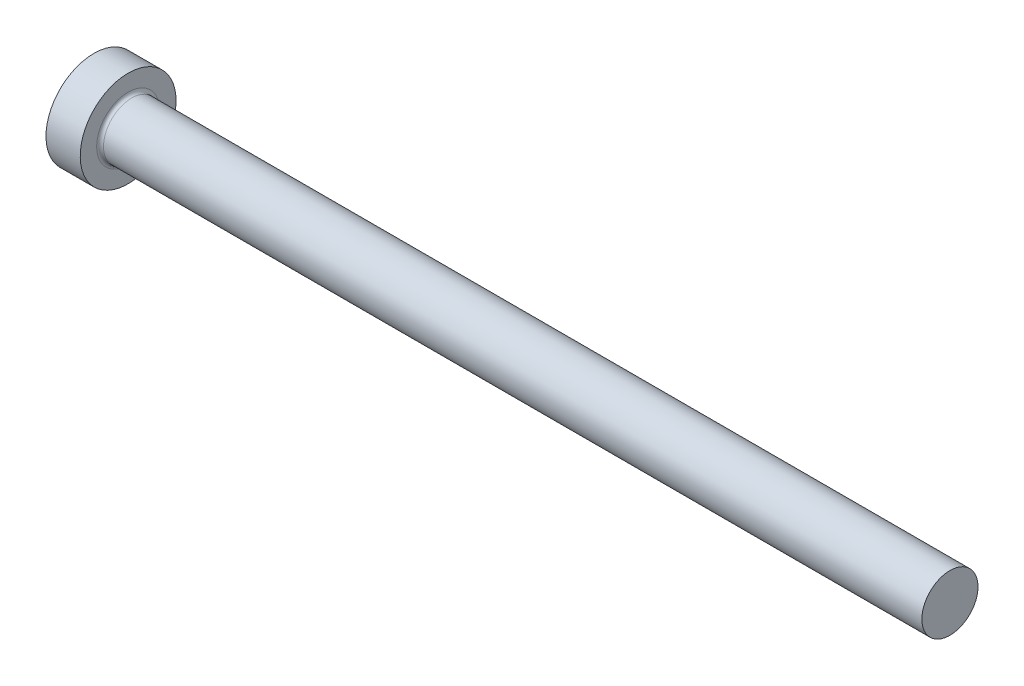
ISO-10303-21;
HEADER;
FILE_DESCRIPTION(('STEP AP214'),'2;1');
FILE_NAME('part.step','',(''),(''),'','','');
FILE_SCHEMA(('AUTOMOTIVE_DESIGN { 1 0 10303 214 1 1 1 1 }'));
ENDSEC;
DATA;
#1=APPLICATION_CONTEXT('core data for automotive mechanical design processes');
#2=APPLICATION_PROTOCOL_DEFINITION('international standard','automotive_design',2000,#1);
#3=PRODUCT_CONTEXT('',#1,'mechanical');
#4=PRODUCT('Part','Part','',(#3));
#5=PRODUCT_RELATED_PRODUCT_CATEGORY('part','',(#4));
#6=PRODUCT_DEFINITION_FORMATION('','',#4);
#7=PRODUCT_DEFINITION_CONTEXT('part definition',#1,'design');
#8=PRODUCT_DEFINITION('design','',#6,#7);
#9=PRODUCT_DEFINITION_SHAPE('','',#8);
#10=(LENGTH_UNIT() NAMED_UNIT(*) SI_UNIT(.MILLI.,.METRE.));
#11=(NAMED_UNIT(*) PLANE_ANGLE_UNIT() SI_UNIT($,.RADIAN.));
#12=(NAMED_UNIT(*) SI_UNIT($,.STERADIAN.) SOLID_ANGLE_UNIT());
#13=UNCERTAINTY_MEASURE_WITH_UNIT(LENGTH_MEASURE(1.E-05),#10,'distance_accuracy_value','');
#14=(GEOMETRIC_REPRESENTATION_CONTEXT(3) GLOBAL_UNCERTAINTY_ASSIGNED_CONTEXT((#13)) GLOBAL_UNIT_ASSIGNED_CONTEXT((#10,
#11,#12)) REPRESENTATION_CONTEXT('',''));
#15=CARTESIAN_POINT('',(0.,0.,0.));
#16=DIRECTION('',(0.,0.,1.));
#17=DIRECTION('',(1.,0.,0.));
#18=AXIS2_PLACEMENT_3D('',#15,#16,#17);
#19=CARTESIAN_POINT('',(0.,0.,0.));
#20=DIRECTION('',(-1.,0.,0.));
#21=DIRECTION('',(0.,-1.,0.));
#22=AXIS2_PLACEMENT_3D('',#19,#20,#21);
#23=PLANE('',#22);
#24=CARTESIAN_POINT('',(0.,0.,0.));
#25=DIRECTION('',(1.,0.,0.));
#26=DIRECTION('',(0.,1.,0.));
#27=AXIS2_PLACEMENT_3D('',#24,#25,#26);
#28=CIRCLE('',#27,7.);
#29=CARTESIAN_POINT('',(0.,7.,0.));
#30=VERTEX_POINT('',#29);
#31=EDGE_CURVE('E25',#30,#30,#28,.T.);
#32=ORIENTED_EDGE('',*,*,#31,.F.);
#33=EDGE_LOOP('',(#32));
#34=FACE_BOUND('',#33,.T.);
#35=ADVANCED_FACE('F14',(#34),#23,.T.);
#36=CARTESIAN_POINT('',(125.,0.,0.));
#37=DIRECTION('',(1.,0.,0.));
#38=DIRECTION('',(0.,1.,0.));
#39=AXIS2_PLACEMENT_3D('',#36,#37,#38);
#40=CYLINDRICAL_SURFACE('',#39,7.);
#41=ORIENTED_EDGE('',*,*,#31,.T.);
#42=EDGE_LOOP('',(#41));
#43=FACE_BOUND('',#42,.T.);
#44=CARTESIAN_POINT('',(5.,0.,0.));
#45=DIRECTION('',(1.,0.,0.));
#46=DIRECTION('',(0.,1.,0.));
#47=AXIS2_PLACEMENT_3D('',#44,#45,#46);
#48=CIRCLE('',#47,7.);
#49=CARTESIAN_POINT('',(5.,7.,0.));
#50=VERTEX_POINT('',#49);
#51=EDGE_CURVE('E29',#50,#50,#48,.T.);
#52=ORIENTED_EDGE('',*,*,#51,.F.);
#53=EDGE_LOOP('',(#52));
#54=FACE_BOUND('',#53,.T.);
#55=ADVANCED_FACE('F51',(#43,#54),#40,.T.);
#56=CARTESIAN_POINT('',(5.,7.,0.));
#57=DIRECTION('',(1.,0.,0.));
#58=DIRECTION('',(0.,1.,0.));
#59=AXIS2_PLACEMENT_3D('',#56,#57,#58);
#60=PLANE('',#59);
#61=CARTESIAN_POINT('',(5.,0.,0.));
#62=DIRECTION('',(1.,0.,0.));
#63=DIRECTION('',(0.,1.,0.));
#64=AXIS2_PLACEMENT_3D('',#61,#62,#63);
#65=CIRCLE('',#64,4.6);
#66=CARTESIAN_POINT('',(5.,4.6,0.));
#67=VERTEX_POINT('',#66);
#68=EDGE_CURVE('E9',#67,#67,#65,.F.);
#69=ORIENTED_EDGE('',*,*,#68,.T.);
#70=EDGE_LOOP('',(#69));
#71=FACE_BOUND('',#70,.T.);
#72=ORIENTED_EDGE('',*,*,#51,.T.);
#73=EDGE_LOOP('',(#72));
#74=FACE_BOUND('',#73,.T.);
#75=ADVANCED_FACE('F42',(#71,#74),#60,.T.);
#76=CARTESIAN_POINT('',(125.,0.,0.));
#77=DIRECTION('',(1.,0.,0.));
#78=DIRECTION('',(0.,1.,0.));
#79=AXIS2_PLACEMENT_3D('',#76,#77,#78);
#80=CYLINDRICAL_SURFACE('',#79,4.1);
#81=CARTESIAN_POINT('',(5.5,0.,0.));
#82=DIRECTION('',(1.,0.,0.));
#83=DIRECTION('',(0.,1.,0.));
#84=AXIS2_PLACEMENT_3D('',#81,#82,#83);
#85=CIRCLE('',#84,4.1);
#86=CARTESIAN_POINT('',(5.5,4.1,0.));
#87=VERTEX_POINT('',#86);
#88=EDGE_CURVE('E21',#87,#87,#85,.T.);
#89=ORIENTED_EDGE('',*,*,#88,.T.);
#90=EDGE_LOOP('',(#89));
#91=FACE_BOUND('',#90,.T.);
#92=CARTESIAN_POINT('',(125.,0.,0.));
#93=DIRECTION('',(1.,0.,0.));
#94=DIRECTION('',(0.,1.,0.));
#95=AXIS2_PLACEMENT_3D('',#92,#93,#94);
#96=CIRCLE('',#95,4.1);
#97=CARTESIAN_POINT('',(125.,4.1,0.));
#98=VERTEX_POINT('',#97);
#99=EDGE_CURVE('E34',#98,#98,#96,.T.);
#100=ORIENTED_EDGE('',*,*,#99,.F.);
#101=EDGE_LOOP('',(#100));
#102=FACE_BOUND('',#101,.T.);
#103=ADVANCED_FACE('F40',(#91,#102),#80,.T.);
#104=CARTESIAN_POINT('',(125.,4.1,0.));
#105=DIRECTION('',(1.,0.,0.));
#106=DIRECTION('',(0.,1.,0.));
#107=AXIS2_PLACEMENT_3D('',#104,#105,#106);
#108=PLANE('',#107);
#109=ORIENTED_EDGE('',*,*,#99,.T.);
#110=EDGE_LOOP('',(#109));
#111=FACE_BOUND('',#110,.T.);
#112=ADVANCED_FACE('F38',(#111),#108,.T.);
#113=CARTESIAN_POINT('',(5.5,0.,0.));
#114=DIRECTION('',(1.,0.,0.));
#115=DIRECTION('',(0.,1.,0.));
#116=AXIS2_PLACEMENT_3D('',#113,#114,#115);
#117=TOROIDAL_SURFACE('',#116,4.6,0.5);
#118=ORIENTED_EDGE('',*,*,#68,.F.);
#119=EDGE_LOOP('',(#118));
#120=FACE_BOUND('',#119,.T.);
#121=ORIENTED_EDGE('',*,*,#88,.F.);
#122=EDGE_LOOP('',(#121));
#123=FACE_BOUND('',#122,.T.);
#124=ADVANCED_FACE('F16',(#120,#123),#117,.F.);
#125=CLOSED_SHELL('',(#35,#55,#75,#103,#112,#124));
#126=MANIFOLD_SOLID_BREP('B1',#125);
#127=ADVANCED_BREP_SHAPE_REPRESENTATION('',(#18,#126),#14);
#128=SHAPE_DEFINITION_REPRESENTATION(#9,#127);
ENDSEC;
END-ISO-10303-21;
